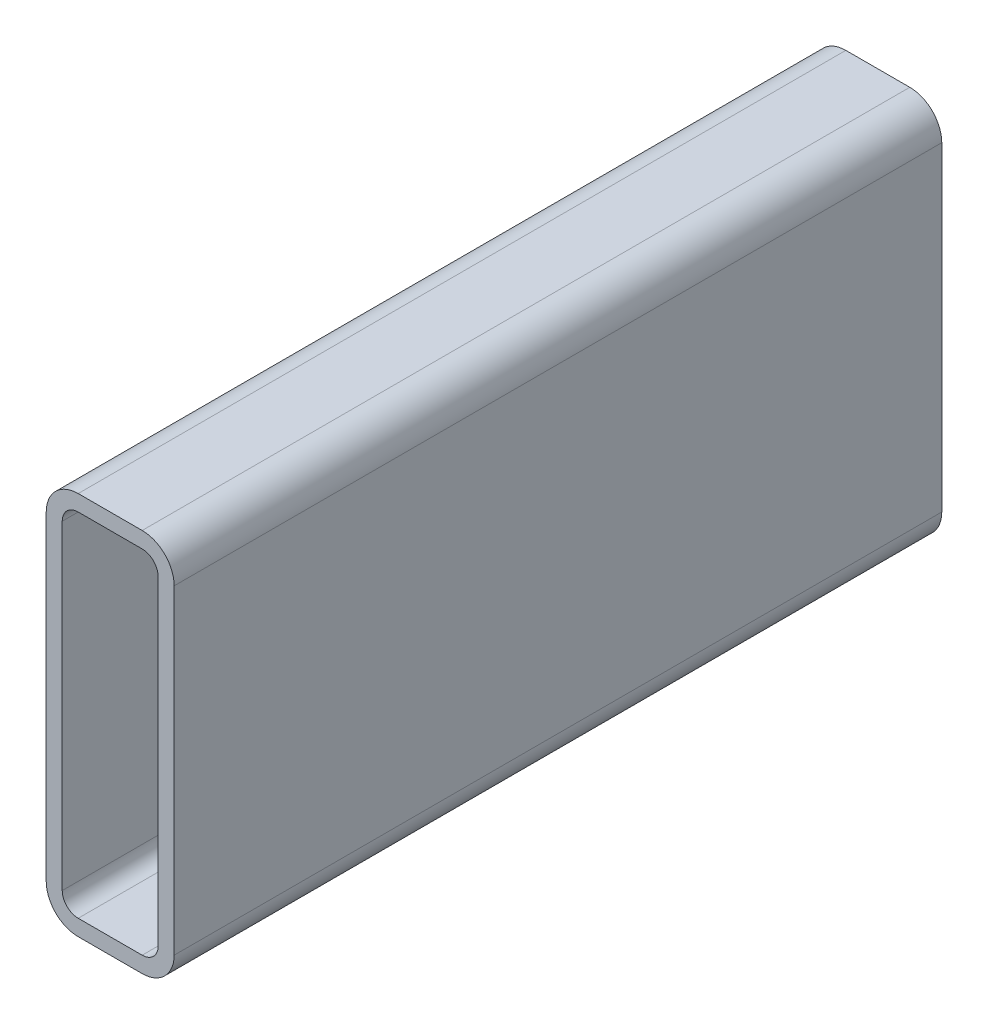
from build123d import *

# Parameters (mm, degrees)
BOSS_EXTRUDE1_DEPTH = 304.8


with BuildPart() as part:
    # Sketch1 → Boss-Extrude1 (new body)
    with BuildSketch(Plane.XY):
        with BuildLine():
            Line((12.7, 152.4), (38.1, 152.4))
            ThreePointArc((38.1, 152.4), (47.080256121, 148.680256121), (50.8, 139.7))
            Line((50.8, 139.7), (50.8, 12.7))
            ThreePointArc((50.8, 12.7), (47.080256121, 3.719743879), (38.1, 0))
            Line((38.1, 0), (12.7, 0))
            ThreePointArc((12.7, 0), (3.719743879, 3.719743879), (0, 12.7))
            Line((0, 12.7), (0, 139.7))
            ThreePointArc((0, 139.7), (3.719743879, 148.680256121), (12.7, 152.4))
        make_face()
        with BuildLine():
            Line((12.7, 146.05), (38.1, 146.05))
            ThreePointArc((38.1, 146.05), (42.590128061, 144.190128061), (44.45, 139.7))
            Line((44.45, 139.7), (44.45, 12.7))
            ThreePointArc((44.45, 12.7), (42.590128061, 8.209871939), (38.1, 6.35))
            Line((38.1, 6.35), (12.7, 6.35))
            ThreePointArc((12.7, 6.35), (8.209871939, 8.209871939), (6.35, 12.7))
            Line((6.35, 12.7), (6.35, 139.7))
            ThreePointArc((6.35, 139.7), (8.209871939, 144.190128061), (12.7, 146.05))
        make_face(mode=Mode.SUBTRACT)
    extrude(amount=BOSS_EXTRUDE1_DEPTH)


solid = part.part
